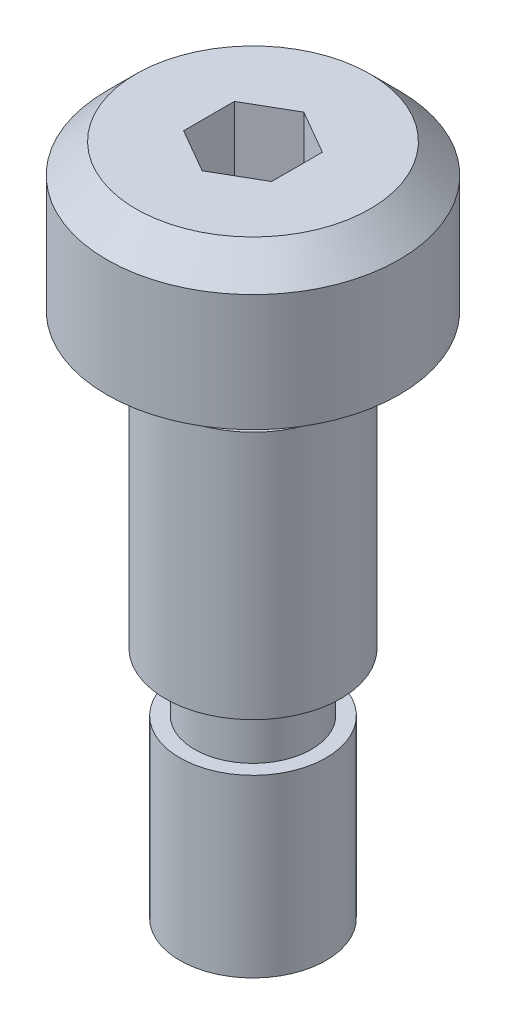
ISO-10303-21;
HEADER;
FILE_DESCRIPTION(('STEP AP214'),'2;1');
FILE_NAME('part.step','',(''),(''),'','','');
FILE_SCHEMA(('AUTOMOTIVE_DESIGN { 1 0 10303 214 1 1 1 1 }'));
ENDSEC;
DATA;
#1=APPLICATION_CONTEXT('core data for automotive mechanical design processes');
#2=APPLICATION_PROTOCOL_DEFINITION('international standard','automotive_design',2000,#1);
#3=PRODUCT_CONTEXT('',#1,'mechanical');
#4=PRODUCT('Part','Part','',(#3));
#5=PRODUCT_RELATED_PRODUCT_CATEGORY('part','',(#4));
#6=PRODUCT_DEFINITION_FORMATION('','',#4);
#7=PRODUCT_DEFINITION_CONTEXT('part definition',#1,'design');
#8=PRODUCT_DEFINITION('design','',#6,#7);
#9=PRODUCT_DEFINITION_SHAPE('','',#8);
#10=(LENGTH_UNIT() NAMED_UNIT(*) SI_UNIT(.MILLI.,.METRE.));
#11=(NAMED_UNIT(*) PLANE_ANGLE_UNIT() SI_UNIT($,.RADIAN.));
#12=(NAMED_UNIT(*) SI_UNIT($,.STERADIAN.) SOLID_ANGLE_UNIT());
#13=UNCERTAINTY_MEASURE_WITH_UNIT(LENGTH_MEASURE(1.E-05),#10,'distance_accuracy_value','');
#14=(GEOMETRIC_REPRESENTATION_CONTEXT(3) GLOBAL_UNCERTAINTY_ASSIGNED_CONTEXT((#13)) GLOBAL_UNIT_ASSIGNED_CONTEXT((#10,
#11,#12)) REPRESENTATION_CONTEXT('',''));
#15=CARTESIAN_POINT('',(0.,0.,0.));
#16=DIRECTION('',(0.,0.,1.));
#17=DIRECTION('',(1.,0.,0.));
#18=AXIS2_PLACEMENT_3D('',#15,#16,#17);
#19=CARTESIAN_POINT('',(0.,0.,0.));
#20=DIRECTION('',(0.,-1.,0.));
#21=DIRECTION('',(0.,0.,-1.));
#22=AXIS2_PLACEMENT_3D('',#19,#20,#21);
#23=PLANE('',#22);
#24=CARTESIAN_POINT('',(0.,0.,0.));
#25=DIRECTION('',(0.,-1.,0.));
#26=DIRECTION('',(0.,0.,-1.));
#27=AXIS2_PLACEMENT_3D('',#24,#25,#26);
#28=CIRCLE('',#27,4.445);
#29=CARTESIAN_POINT('',(0.,0.,-4.445));
#30=VERTEX_POINT('',#29);
#31=EDGE_CURVE('E11',#30,#30,#28,.T.);
#32=ORIENTED_EDGE('',*,*,#31,.F.);
#33=EDGE_LOOP('',(#32));
#34=FACE_BOUND('',#33,.T.);
#35=CARTESIAN_POINT('',(0.,0.,0.));
#36=DIRECTION('',(0.,-1.,0.));
#37=DIRECTION('',(0.,0.,-1.));
#38=AXIS2_PLACEMENT_3D('',#35,#36,#37);
#39=CIRCLE('',#38,7.9375);
#40=CARTESIAN_POINT('',(0.,0.,-7.9375));
#41=VERTEX_POINT('',#40);
#42=EDGE_CURVE('E39',#41,#41,#39,.T.);
#43=ORIENTED_EDGE('',*,*,#42,.T.);
#44=EDGE_LOOP('',(#43));
#45=FACE_BOUND('',#44,.T.);
#46=ADVANCED_FACE('F32',(#34,#45),#23,.T.);
#47=CARTESIAN_POINT('',(0.,0.,0.));
#48=DIRECTION('',(0.,-1.,0.));
#49=DIRECTION('',(0.,0.,-1.));
#50=AXIS2_PLACEMENT_3D('',#47,#48,#49);
#51=CYLINDRICAL_SURFACE('',#50,7.9375);
#52=CARTESIAN_POINT('',(0.,6.35,0.));
#53=DIRECTION('',(0.,-1.,0.));
#54=DIRECTION('',(0.,0.,-1.));
#55=AXIS2_PLACEMENT_3D('',#52,#53,#54);
#56=CIRCLE('',#55,7.9375);
#57=CARTESIAN_POINT('',(0.,6.35,-7.9375));
#58=VERTEX_POINT('',#57);
#59=EDGE_CURVE('E164',#58,#58,#56,.T.);
#60=ORIENTED_EDGE('',*,*,#59,.T.);
#61=EDGE_LOOP('',(#60));
#62=FACE_BOUND('',#61,.T.);
#63=ORIENTED_EDGE('',*,*,#42,.F.);
#64=EDGE_LOOP('',(#63));
#65=FACE_BOUND('',#64,.T.);
#66=ADVANCED_FACE('F170',(#62,#65),#51,.T.);
#67=CARTESIAN_POINT('',(0.,6.35,0.));
#68=DIRECTION('',(0.,-1.,0.));
#69=DIRECTION('',(0.,0.,-1.));
#70=AXIS2_PLACEMENT_3D('',#67,#68,#69);
#71=CONICAL_SURFACE('',#70,7.9375,0.785398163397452);
#72=CARTESIAN_POINT('',(0.,7.93749999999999,0.));
#73=DIRECTION('',(0.,-1.,0.));
#74=DIRECTION('',(0.,0.,-1.));
#75=AXIS2_PLACEMENT_3D('',#72,#73,#74);
#76=CIRCLE('',#75,6.35);
#77=CARTESIAN_POINT('',(0.,7.93749999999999,-6.35));
#78=VERTEX_POINT('',#77);
#79=EDGE_CURVE('E161',#78,#78,#76,.T.);
#80=ORIENTED_EDGE('',*,*,#79,.T.);
#81=EDGE_LOOP('',(#80));
#82=FACE_BOUND('',#81,.T.);
#83=ORIENTED_EDGE('',*,*,#59,.F.);
#84=EDGE_LOOP('',(#83));
#85=FACE_BOUND('',#84,.T.);
#86=ADVANCED_FACE('F172',(#82,#85),#71,.T.);
#87=CARTESIAN_POINT('',(6.35,7.93749999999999,0.));
#88=DIRECTION('',(0.,1.,0.));
#89=DIRECTION('',(0.,0.,1.));
#90=AXIS2_PLACEMENT_3D('',#87,#88,#89);
#91=PLANE('',#90);
#92=DIRECTION('',(-4.53589793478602E-07,0.,0.999999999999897));
#93=VECTOR('',#92,1.);
#94=CARTESIAN_POINT('',(-2.38759668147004,7.93749999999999,-1.37848223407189));
#95=LINE('',#94,#93);
#96=CARTESIAN_POINT('',(-2.38759668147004,7.93749999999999,-1.37848223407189));
#97=VERTEX_POINT('',#96);
#98=CARTESIAN_POINT('',(-2.387597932,7.93749999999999,1.37848006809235));
#99=VERTEX_POINT('',#98);
#100=EDGE_CURVE('E46',#97,#99,#95,.T.);
#101=ORIENTED_EDGE('',*,*,#100,.F.);
#102=DIRECTION('',(-0.866025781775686,0.,0.499999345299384));
#103=VECTOR('',#102,1.);
#104=CARTESIAN_POINT('',(1.87579371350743E-06,7.93749999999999,-2.75696049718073));
#105=LINE('',#104,#103);
#106=CARTESIAN_POINT('',(1.87579371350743E-06,7.93749999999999,-2.75696049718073));
#107=VERTEX_POINT('',#106);
#108=EDGE_CURVE('E116',#107,#97,#105,.T.);
#109=ORIENTED_EDGE('',*,*,#108,.F.);
#110=DIRECTION('',(-0.866025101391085,0.,-0.500000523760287));
#111=VECTOR('',#110,1.);
#112=CARTESIAN_POINT('',(2.38759855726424,7.93749999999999,-1.37847898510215));
#113=LINE('',#112,#111);
#114=CARTESIAN_POINT('',(2.38759855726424,7.93749999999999,-1.37847898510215));
#115=VERTEX_POINT('',#114);
#116=EDGE_CURVE('E110',#115,#107,#113,.T.);
#117=ORIENTED_EDGE('',*,*,#116,.F.);
#118=DIRECTION('',(4.53589793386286E-07,0.,-0.999999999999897));
#119=VECTOR('',#118,1.);
#120=CARTESIAN_POINT('',(2.38759730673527,7.93749999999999,1.37848115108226));
#121=LINE('',#120,#119);
#122=CARTESIAN_POINT('',(2.38759730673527,7.93749999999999,1.37848115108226));
#123=VERTEX_POINT('',#122);
#124=EDGE_CURVE('E108',#123,#115,#121,.T.);
#125=ORIENTED_EDGE('',*,*,#124,.F.);
#126=DIRECTION('',(0.866025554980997,0.,-0.499999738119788));
#127=VECTOR('',#126,1.);
#128=CARTESIAN_POINT('',(-6.25264571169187E-07,7.93749999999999,2.7569604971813));
#129=LINE('',#128,#127);
#130=CARTESIAN_POINT('',(-6.25264571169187E-07,7.93749999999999,2.7569604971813));
#131=VERTEX_POINT('',#130);
#132=EDGE_CURVE('E89',#131,#123,#129,.T.);
#133=ORIENTED_EDGE('',*,*,#132,.F.);
#134=DIRECTION('',(0.86602532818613,0.,0.500000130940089));
#135=VECTOR('',#134,1.);
#136=CARTESIAN_POINT('',(-2.387597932,7.93749999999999,1.37848006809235));
#137=LINE('',#136,#135);
#138=EDGE_CURVE('E100',#99,#131,#137,.T.);
#139=ORIENTED_EDGE('',*,*,#138,.F.);
#140=EDGE_LOOP('',(#101,#109,#117,#125,#133,#139));
#141=FACE_BOUND('',#140,.T.);
#142=ORIENTED_EDGE('',*,*,#79,.F.);
#143=EDGE_LOOP('',(#142));
#144=FACE_BOUND('',#143,.T.);
#145=ADVANCED_FACE('F104',(#141,#144),#91,.T.);
#146=CARTESIAN_POINT('',(0.,-28.575,0.));
#147=DIRECTION('',(0.,-1.,0.));
#148=DIRECTION('',(0.,0.,-1.));
#149=AXIS2_PLACEMENT_3D('',#146,#147,#148);
#150=PLANE('',#149);
#151=CARTESIAN_POINT('',(0.,-28.575,0.));
#152=DIRECTION('',(0.,-1.,0.));
#153=DIRECTION('',(0.,0.,-1.));
#154=AXIS2_PLACEMENT_3D('',#151,#152,#153);
#155=CIRCLE('',#154,3.96875);
#156=CARTESIAN_POINT('',(0.,-28.575,-3.96875));
#157=VERTEX_POINT('',#156);
#158=EDGE_CURVE('E158',#157,#157,#155,.T.);
#159=ORIENTED_EDGE('',*,*,#158,.T.);
#160=EDGE_LOOP('',(#159));
#161=FACE_BOUND('',#160,.T.);
#162=ADVANCED_FACE('F184',(#161),#150,.T.);
#163=CARTESIAN_POINT('',(0.,0.,0.));
#164=DIRECTION('',(0.,-1.,0.));
#165=DIRECTION('',(0.,0.,-1.));
#166=AXIS2_PLACEMENT_3D('',#163,#164,#165);
#167=CYLINDRICAL_SURFACE('',#166,3.96875);
#168=CARTESIAN_POINT('',(0.,-19.05,0.));
#169=DIRECTION('',(0.,-1.,0.));
#170=DIRECTION('',(0.,0.,-1.));
#171=AXIS2_PLACEMENT_3D('',#168,#169,#170);
#172=CIRCLE('',#171,3.96875);
#173=CARTESIAN_POINT('',(0.,-19.05,-3.96875));
#174=VERTEX_POINT('',#173);
#175=EDGE_CURVE('E155',#174,#174,#172,.T.);
#176=ORIENTED_EDGE('',*,*,#175,.T.);
#177=EDGE_LOOP('',(#176));
#178=FACE_BOUND('',#177,.T.);
#179=ORIENTED_EDGE('',*,*,#158,.F.);
#180=EDGE_LOOP('',(#179));
#181=FACE_BOUND('',#180,.T.);
#182=ADVANCED_FACE('F187',(#178,#181),#167,.T.);
#183=CARTESIAN_POINT('',(3.96875,-19.05,0.));
#184=DIRECTION('',(0.,1.,0.));
#185=DIRECTION('',(0.,0.,1.));
#186=AXIS2_PLACEMENT_3D('',#183,#184,#185);
#187=PLANE('',#186);
#188=CARTESIAN_POINT('',(0.,-19.05,0.));
#189=DIRECTION('',(0.,-1.,0.));
#190=DIRECTION('',(0.,0.,-1.));
#191=AXIS2_PLACEMENT_3D('',#188,#189,#190);
#192=CIRCLE('',#191,3.175);
#193=CARTESIAN_POINT('',(0.,-19.05,-3.175));
#194=VERTEX_POINT('',#193);
#195=EDGE_CURVE('E152',#194,#194,#192,.T.);
#196=ORIENTED_EDGE('',*,*,#195,.T.);
#197=EDGE_LOOP('',(#196));
#198=FACE_BOUND('',#197,.T.);
#199=ORIENTED_EDGE('',*,*,#175,.F.);
#200=EDGE_LOOP('',(#199));
#201=FACE_BOUND('',#200,.T.);
#202=ADVANCED_FACE('F191',(#198,#201),#187,.T.);
#203=CARTESIAN_POINT('',(0.,0.,0.));
#204=DIRECTION('',(0.,-1.,0.));
#205=DIRECTION('',(0.,0.,-1.));
#206=AXIS2_PLACEMENT_3D('',#203,#204,#205);
#207=CYLINDRICAL_SURFACE('',#206,3.175);
#208=CARTESIAN_POINT('',(0.,-15.875,0.));
#209=DIRECTION('',(0.,-1.,0.));
#210=DIRECTION('',(0.,0.,-1.));
#211=AXIS2_PLACEMENT_3D('',#208,#209,#210);
#212=CIRCLE('',#211,3.175);
#213=CARTESIAN_POINT('',(0.,-15.875,-3.175));
#214=VERTEX_POINT('',#213);
#215=EDGE_CURVE('E149',#214,#214,#212,.T.);
#216=ORIENTED_EDGE('',*,*,#215,.T.);
#217=EDGE_LOOP('',(#216));
#218=FACE_BOUND('',#217,.T.);
#219=ORIENTED_EDGE('',*,*,#195,.F.);
#220=EDGE_LOOP('',(#219));
#221=FACE_BOUND('',#220,.T.);
#222=ADVANCED_FACE('F195',(#218,#221),#207,.T.);
#223=CARTESIAN_POINT('',(3.175,-15.875,0.));
#224=DIRECTION('',(0.,-1.,0.));
#225=DIRECTION('',(0.,0.,-1.));
#226=AXIS2_PLACEMENT_3D('',#223,#224,#225);
#227=PLANE('',#226);
#228=CARTESIAN_POINT('',(0.,-15.875,0.));
#229=DIRECTION('',(0.,-1.,0.));
#230=DIRECTION('',(0.,0.,-1.));
#231=AXIS2_PLACEMENT_3D('',#228,#229,#230);
#232=CIRCLE('',#231,4.7625);
#233=CARTESIAN_POINT('',(0.,-15.875,-4.7625));
#234=VERTEX_POINT('',#233);
#235=EDGE_CURVE('E146',#234,#234,#232,.T.);
#236=ORIENTED_EDGE('',*,*,#235,.T.);
#237=EDGE_LOOP('',(#236));
#238=FACE_BOUND('',#237,.T.);
#239=ORIENTED_EDGE('',*,*,#215,.F.);
#240=EDGE_LOOP('',(#239));
#241=FACE_BOUND('',#240,.T.);
#242=ADVANCED_FACE('F199',(#238,#241),#227,.T.);
#243=CARTESIAN_POINT('',(0.,0.,0.));
#244=DIRECTION('',(0.,-1.,0.));
#245=DIRECTION('',(0.,0.,-1.));
#246=AXIS2_PLACEMENT_3D('',#243,#244,#245);
#247=CYLINDRICAL_SURFACE('',#246,4.7625);
#248=CARTESIAN_POINT('',(0.,-2.362197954,0.));
#249=DIRECTION('',(0.,-1.,0.));
#250=DIRECTION('',(0.,0.,-1.));
#251=AXIS2_PLACEMENT_3D('',#248,#249,#250);
#252=CIRCLE('',#251,4.7625);
#253=CARTESIAN_POINT('',(0.,-2.362197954,-4.7625));
#254=VERTEX_POINT('',#253);
#255=EDGE_CURVE('E143',#254,#254,#252,.T.);
#256=ORIENTED_EDGE('',*,*,#255,.T.);
#257=EDGE_LOOP('',(#256));
#258=FACE_BOUND('',#257,.T.);
#259=ORIENTED_EDGE('',*,*,#235,.F.);
#260=EDGE_LOOP('',(#259));
#261=FACE_BOUND('',#260,.T.);
#262=ADVANCED_FACE('F203',(#258,#261),#247,.T.);
#263=CARTESIAN_POINT('',(4.7625,-2.362197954,0.));
#264=DIRECTION('',(0.,1.,0.));
#265=DIRECTION('',(0.,0.,1.));
#266=AXIS2_PLACEMENT_3D('',#263,#264,#265);
#267=PLANE('',#266);
#268=CARTESIAN_POINT('',(0.,-2.362197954,0.));
#269=DIRECTION('',(0.,-1.,0.));
#270=DIRECTION('',(0.,0.,-1.));
#271=AXIS2_PLACEMENT_3D('',#268,#269,#270);
#272=CIRCLE('',#271,4.445);
#273=CARTESIAN_POINT('',(0.,-2.362197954,-4.445));
#274=VERTEX_POINT('',#273);
#275=EDGE_CURVE('E134',#274,#274,#272,.T.);
#276=ORIENTED_EDGE('',*,*,#275,.T.);
#277=EDGE_LOOP('',(#276));
#278=FACE_BOUND('',#277,.T.);
#279=ORIENTED_EDGE('',*,*,#255,.F.);
#280=EDGE_LOOP('',(#279));
#281=FACE_BOUND('',#280,.T.);
#282=ADVANCED_FACE('F207',(#278,#281),#267,.T.);
#283=CARTESIAN_POINT('',(0.,0.,0.));
#284=DIRECTION('',(0.,-1.,0.));
#285=DIRECTION('',(0.,0.,-1.));
#286=AXIS2_PLACEMENT_3D('',#283,#284,#285);
#287=CYLINDRICAL_SURFACE('',#286,4.445);
#288=ORIENTED_EDGE('',*,*,#31,.T.);
#289=EDGE_LOOP('',(#288));
#290=FACE_BOUND('',#289,.T.);
#291=ORIENTED_EDGE('',*,*,#275,.F.);
#292=EDGE_LOOP('',(#291));
#293=FACE_BOUND('',#292,.T.);
#294=ADVANCED_FACE('F211',(#290,#293),#287,.T.);
#295=CARTESIAN_POINT('',(-2.38759668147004,4.35610310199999,-1.37848223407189));
#296=DIRECTION('',(-0.999999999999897,0.,-4.53589793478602E-07));
#297=DIRECTION('',(-4.53589793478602E-07,0.,0.999999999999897));
#298=AXIS2_PLACEMENT_3D('',#295,#296,#297);
#299=PLANE('',#298);
#300=ORIENTED_EDGE('',*,*,#100,.T.);
#301=DIRECTION('',(0.,1.,0.));
#302=VECTOR('',#301,1.);
#303=CARTESIAN_POINT('',(-2.387597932,4.35610310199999,1.37848006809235));
#304=LINE('',#303,#302);
#305=CARTESIAN_POINT('',(-2.387597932,4.35610310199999,1.37848006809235));
#306=VERTEX_POINT('',#305);
#307=EDGE_CURVE('E97',#306,#99,#304,.T.);
#308=ORIENTED_EDGE('',*,*,#307,.F.);
#309=DIRECTION('',(-4.53589793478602E-07,0.,0.999999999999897));
#310=VECTOR('',#309,1.);
#311=CARTESIAN_POINT('',(-2.38759668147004,4.35610310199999,-1.37848223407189));
#312=LINE('',#311,#310);
#313=CARTESIAN_POINT('',(-2.38759668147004,4.35610310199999,-1.37848223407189));
#314=VERTEX_POINT('',#313);
#315=EDGE_CURVE('E118',#314,#306,#312,.T.);
#316=ORIENTED_EDGE('',*,*,#315,.F.);
#317=DIRECTION('',(0.,1.,0.));
#318=VECTOR('',#317,1.);
#319=CARTESIAN_POINT('',(-2.38759668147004,4.35610310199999,-1.37848223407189));
#320=LINE('',#319,#318);
#321=EDGE_CURVE('E53',#314,#97,#320,.T.);
#322=ORIENTED_EDGE('',*,*,#321,.T.);
#323=EDGE_LOOP('',(#300,#308,#316,#322));
#324=FACE_BOUND('',#323,.T.);
#325=ADVANCED_FACE('F215',(#324),#299,.F.);
#326=CARTESIAN_POINT('',(1.87579371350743E-06,4.35610310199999,-2.75696049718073));
#327=DIRECTION('',(-0.499999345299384,0.,-0.866025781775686));
#328=DIRECTION('',(-0.866025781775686,0.,0.499999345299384));
#329=AXIS2_PLACEMENT_3D('',#326,#327,#328);
#330=PLANE('',#329);
#331=ORIENTED_EDGE('',*,*,#108,.T.);
#332=ORIENTED_EDGE('',*,*,#321,.F.);
#333=DIRECTION('',(-0.866025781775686,0.,0.499999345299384));
#334=VECTOR('',#333,1.);
#335=CARTESIAN_POINT('',(1.87579371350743E-06,4.35610310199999,-2.75696049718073));
#336=LINE('',#335,#334);
#337=CARTESIAN_POINT('',(1.87579371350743E-06,4.35610310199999,-2.75696049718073));
#338=VERTEX_POINT('',#337);
#339=EDGE_CURVE('E130',#338,#314,#336,.T.);
#340=ORIENTED_EDGE('',*,*,#339,.F.);
#341=DIRECTION('',(0.,1.,0.));
#342=VECTOR('',#341,1.);
#343=CARTESIAN_POINT('',(1.87579371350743E-06,4.35610310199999,-2.75696049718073));
#344=LINE('',#343,#342);
#345=EDGE_CURVE('E135',#338,#107,#344,.T.);
#346=ORIENTED_EDGE('',*,*,#345,.T.);
#347=EDGE_LOOP('',(#331,#332,#340,#346));
#348=FACE_BOUND('',#347,.T.);
#349=ADVANCED_FACE('F219',(#348),#330,.F.);
#350=CARTESIAN_POINT('',(2.38759855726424,4.35610310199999,-1.37847898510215));
#351=DIRECTION('',(0.500000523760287,0.,-0.866025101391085));
#352=DIRECTION('',(-0.866025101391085,0.,-0.500000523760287));
#353=AXIS2_PLACEMENT_3D('',#350,#351,#352);
#354=PLANE('',#353);
#355=ORIENTED_EDGE('',*,*,#116,.T.);
#356=ORIENTED_EDGE('',*,*,#345,.F.);
#357=DIRECTION('',(-0.866025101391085,0.,-0.500000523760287));
#358=VECTOR('',#357,1.);
#359=CARTESIAN_POINT('',(2.38759855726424,4.35610310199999,-1.37847898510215));
#360=LINE('',#359,#358);
#361=CARTESIAN_POINT('',(2.38759855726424,4.35610310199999,-1.37847898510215));
#362=VERTEX_POINT('',#361);
#363=EDGE_CURVE('E127',#362,#338,#360,.T.);
#364=ORIENTED_EDGE('',*,*,#363,.F.);
#365=DIRECTION('',(0.,1.,0.));
#366=VECTOR('',#365,1.);
#367=CARTESIAN_POINT('',(2.38759855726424,4.35610310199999,-1.37847898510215));
#368=LINE('',#367,#366);
#369=EDGE_CURVE('E137',#362,#115,#368,.T.);
#370=ORIENTED_EDGE('',*,*,#369,.T.);
#371=EDGE_LOOP('',(#355,#356,#364,#370));
#372=FACE_BOUND('',#371,.T.);
#373=ADVANCED_FACE('F228',(#372),#354,.F.);
#374=CARTESIAN_POINT('',(2.38759730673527,4.35610310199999,1.37848115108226));
#375=DIRECTION('',(0.999999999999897,0.,4.53589793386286E-07));
#376=DIRECTION('',(4.53589793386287E-07,0.,-0.999999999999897));
#377=AXIS2_PLACEMENT_3D('',#374,#375,#376);
#378=PLANE('',#377);
#379=ORIENTED_EDGE('',*,*,#124,.T.);
#380=ORIENTED_EDGE('',*,*,#369,.F.);
#381=DIRECTION('',(4.53589793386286E-07,0.,-0.999999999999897));
#382=VECTOR('',#381,1.);
#383=CARTESIAN_POINT('',(2.38759730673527,4.35610310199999,1.37848115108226));
#384=LINE('',#383,#382);
#385=CARTESIAN_POINT('',(2.38759730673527,4.35610310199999,1.37848115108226));
#386=VERTEX_POINT('',#385);
#387=EDGE_CURVE('E124',#386,#362,#384,.T.);
#388=ORIENTED_EDGE('',*,*,#387,.F.);
#389=DIRECTION('',(0.,1.,0.));
#390=VECTOR('',#389,1.);
#391=CARTESIAN_POINT('',(2.38759730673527,4.35610310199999,1.37848115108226));
#392=LINE('',#391,#390);
#393=EDGE_CURVE('E96',#386,#123,#392,.T.);
#394=ORIENTED_EDGE('',*,*,#393,.T.);
#395=EDGE_LOOP('',(#379,#380,#388,#394));
#396=FACE_BOUND('',#395,.T.);
#397=ADVANCED_FACE('F225',(#396),#378,.F.);
#398=CARTESIAN_POINT('',(-6.25264571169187E-07,4.35610310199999,2.7569604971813));
#399=DIRECTION('',(0.499999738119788,0.,0.866025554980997));
#400=DIRECTION('',(0.866025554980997,0.,-0.499999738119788));
#401=AXIS2_PLACEMENT_3D('',#398,#399,#400);
#402=PLANE('',#401);
#403=ORIENTED_EDGE('',*,*,#132,.T.);
#404=ORIENTED_EDGE('',*,*,#393,.F.);
#405=DIRECTION('',(0.866025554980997,0.,-0.499999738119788));
#406=VECTOR('',#405,1.);
#407=CARTESIAN_POINT('',(-6.25264571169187E-07,4.35610310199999,2.7569604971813));
#408=LINE('',#407,#406);
#409=CARTESIAN_POINT('',(-6.25264571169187E-07,4.35610310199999,2.7569604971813));
#410=VERTEX_POINT('',#409);
#411=EDGE_CURVE('E92',#410,#386,#408,.T.);
#412=ORIENTED_EDGE('',*,*,#411,.F.);
#413=DIRECTION('',(0.,1.,0.));
#414=VECTOR('',#413,1.);
#415=CARTESIAN_POINT('',(-6.25264571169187E-07,4.35610310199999,2.7569604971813));
#416=LINE('',#415,#414);
#417=EDGE_CURVE('E85',#410,#131,#416,.T.);
#418=ORIENTED_EDGE('',*,*,#417,.T.);
#419=EDGE_LOOP('',(#403,#404,#412,#418));
#420=FACE_BOUND('',#419,.T.);
#421=ADVANCED_FACE('F87',(#420),#402,.F.);
#422=CARTESIAN_POINT('',(-2.387597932,4.35610310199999,1.37848006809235));
#423=DIRECTION('',(-0.500000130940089,0.,0.86602532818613));
#424=DIRECTION('',(0.86602532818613,0.,0.500000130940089));
#425=AXIS2_PLACEMENT_3D('',#422,#423,#424);
#426=PLANE('',#425);
#427=ORIENTED_EDGE('',*,*,#138,.T.);
#428=ORIENTED_EDGE('',*,*,#417,.F.);
#429=DIRECTION('',(0.86602532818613,0.,0.500000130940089));
#430=VECTOR('',#429,1.);
#431=CARTESIAN_POINT('',(-2.387597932,4.35610310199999,1.37848006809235));
#432=LINE('',#431,#430);
#433=EDGE_CURVE('E121',#306,#410,#432,.T.);
#434=ORIENTED_EDGE('',*,*,#433,.F.);
#435=ORIENTED_EDGE('',*,*,#307,.T.);
#436=EDGE_LOOP('',(#427,#428,#434,#435));
#437=FACE_BOUND('',#436,.T.);
#438=ADVANCED_FACE('F101',(#437),#426,.F.);
#439=CARTESIAN_POINT('',(-2.387597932,4.35610310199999,1.37848006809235));
#440=DIRECTION('',(0.,1.,0.));
#441=DIRECTION('',(0.,0.,1.));
#442=AXIS2_PLACEMENT_3D('',#439,#440,#441);
#443=PLANE('',#442);
#444=ORIENTED_EDGE('',*,*,#315,.T.);
#445=ORIENTED_EDGE('',*,*,#433,.T.);
#446=ORIENTED_EDGE('',*,*,#411,.T.);
#447=ORIENTED_EDGE('',*,*,#387,.T.);
#448=ORIENTED_EDGE('',*,*,#363,.T.);
#449=ORIENTED_EDGE('',*,*,#339,.T.);
#450=EDGE_LOOP('',(#444,#445,#446,#447,#448,#449));
#451=FACE_BOUND('',#450,.T.);
#452=ADVANCED_FACE('F222',(#451),#443,.T.);
#453=CLOSED_SHELL('',(#46,#66,#86,#145,#162,#182,#202,#222,#242,#262,#282,#294,#325,#349,#373,
#397,#421,#438,#452));
#454=MANIFOLD_SOLID_BREP('B2',#453);
#455=ADVANCED_BREP_SHAPE_REPRESENTATION('',(#18,#454),#14);
#456=SHAPE_DEFINITION_REPRESENTATION(#9,#455);
ENDSEC;
END-ISO-10303-21;
